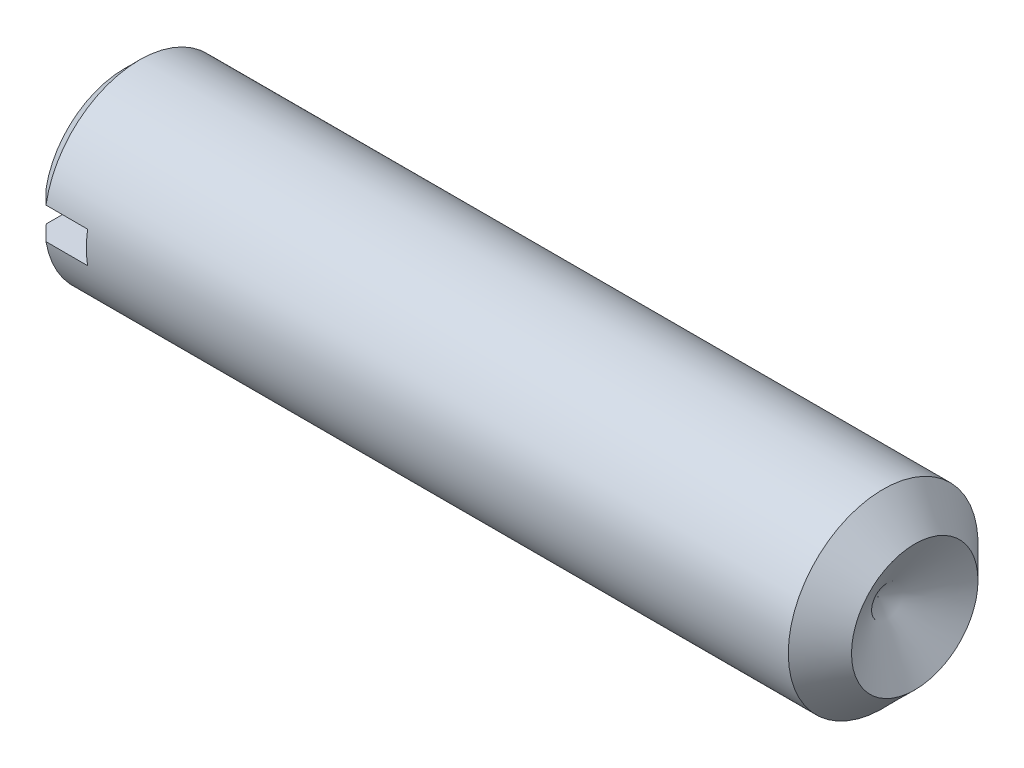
ISO-10303-21;
HEADER;
FILE_DESCRIPTION(('STEP AP214'),'2;1');
FILE_NAME('part.step','',(''),(''),'','','');
FILE_SCHEMA(('AUTOMOTIVE_DESIGN { 1 0 10303 214 1 1 1 1 }'));
ENDSEC;
DATA;
#1=APPLICATION_CONTEXT('core data for automotive mechanical design processes');
#2=APPLICATION_PROTOCOL_DEFINITION('international standard','automotive_design',2000,#1);
#3=PRODUCT_CONTEXT('',#1,'mechanical');
#4=PRODUCT('Part','Part','',(#3));
#5=PRODUCT_RELATED_PRODUCT_CATEGORY('part','',(#4));
#6=PRODUCT_DEFINITION_FORMATION('','',#4);
#7=PRODUCT_DEFINITION_CONTEXT('part definition',#1,'design');
#8=PRODUCT_DEFINITION('design','',#6,#7);
#9=PRODUCT_DEFINITION_SHAPE('','',#8);
#10=(LENGTH_UNIT() NAMED_UNIT(*) SI_UNIT(.MILLI.,.METRE.));
#11=(NAMED_UNIT(*) PLANE_ANGLE_UNIT() SI_UNIT($,.RADIAN.));
#12=(NAMED_UNIT(*) SI_UNIT($,.STERADIAN.) SOLID_ANGLE_UNIT());
#13=UNCERTAINTY_MEASURE_WITH_UNIT(LENGTH_MEASURE(1.E-05),#10,'distance_accuracy_value','');
#14=(GEOMETRIC_REPRESENTATION_CONTEXT(3) GLOBAL_UNCERTAINTY_ASSIGNED_CONTEXT((#13)) GLOBAL_UNIT_ASSIGNED_CONTEXT((#10,
#11,#12)) REPRESENTATION_CONTEXT('',''));
#15=CARTESIAN_POINT('',(0.,0.,0.));
#16=DIRECTION('',(0.,0.,1.));
#17=DIRECTION('',(1.,0.,0.));
#18=AXIS2_PLACEMENT_3D('',#15,#16,#17);
#19=CARTESIAN_POINT('',(0.,0.,0.));
#20=DIRECTION('',(1.,0.,0.));
#21=DIRECTION('',(0.,0.,-1.));
#22=AXIS2_PLACEMENT_3D('',#19,#20,#21);
#23=PLANE('',#22);
#24=DIRECTION('',(0.,0.,-1.));
#25=VECTOR('',#24,1.);
#26=CARTESIAN_POINT('',(0.,-1.,6.));
#27=LINE('',#26,#25);
#28=CARTESIAN_POINT('',(0.,-1.,4.93571636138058));
#29=VERTEX_POINT('',#28);
#30=CARTESIAN_POINT('',(0.,-1.,-4.93571636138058));
#31=VERTEX_POINT('',#30);
#32=EDGE_CURVE('E171',#29,#31,#27,.T.);
#33=ORIENTED_EDGE('',*,*,#32,.T.);
#34=CARTESIAN_POINT('',(0.,0.,0.));
#35=DIRECTION('',(-1.,0.,0.));
#36=DIRECTION('',(0.,0.,1.));
#37=AXIS2_PLACEMENT_3D('',#34,#35,#36);
#38=CIRCLE('',#37,5.036);
#39=EDGE_CURVE('E113',#31,#29,#38,.T.);
#40=ORIENTED_EDGE('',*,*,#39,.T.);
#41=EDGE_LOOP('',(#33,#40));
#42=FACE_BOUND('',#41,.T.);
#43=ADVANCED_FACE('F33',(#42),#23,.F.);
#44=DIRECTION('',(0.,0.,1.));
#45=VECTOR('',#44,1.);
#46=CARTESIAN_POINT('',(0.,1.,6.));
#47=LINE('',#46,#45);
#48=CARTESIAN_POINT('',(0.,1.,-4.93571636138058));
#49=VERTEX_POINT('',#48);
#50=CARTESIAN_POINT('',(0.,1.,4.93571636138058));
#51=VERTEX_POINT('',#50);
#52=EDGE_CURVE('E99',#49,#51,#47,.T.);
#53=ORIENTED_EDGE('',*,*,#52,.T.);
#54=EDGE_CURVE('E109',#51,#49,#38,.T.);
#55=ORIENTED_EDGE('',*,*,#54,.T.);
#56=EDGE_LOOP('',(#53,#55));
#57=FACE_BOUND('',#56,.T.);
#58=ADVANCED_FACE('F165',(#57),#23,.F.);
#59=CARTESIAN_POINT('',(0.964,0.,0.));
#60=DIRECTION('',(1.,0.,0.));
#61=DIRECTION('',(0.,0.,-1.));
#62=AXIS2_PLACEMENT_3D('',#59,#60,#61);
#63=CONICAL_SURFACE('',#62,6.,0.785398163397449);
#64=CARTESIAN_POINT('',(8.18739503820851,-1.,-13.185529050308));
#65=CARTESIAN_POINT('',(7.72173696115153,-1.,-12.71852199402));
#66=CARTESIAN_POINT('',(7.25613875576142,-1.,-12.2514551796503));
#67=CARTESIAN_POINT('',(6.32512700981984,-1.,-11.3171039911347));
#68=CARTESIAN_POINT('',(5.85971347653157,-1.,-10.8498196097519));
#69=CARTESIAN_POINT('',(4.92876157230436,-1.,-9.91455900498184));
#70=CARTESIAN_POINT('',(4.46322344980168,-1.,-9.44658253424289));
#71=CARTESIAN_POINT('',(3.53260322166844,-1.,-8.51020895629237));
#72=CARTESIAN_POINT('',(3.06752110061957,-1.,-8.04181186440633));
#73=CARTESIAN_POINT('',(2.15821966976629,-1.,-7.12462717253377));
#74=CARTESIAN_POINT('',(1.71396996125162,-1.,-6.67586973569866));
#75=CARTESIAN_POINT('',(1.04846409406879,-1.,-6.00182834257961));
#76=CARTESIAN_POINT('',(0.826761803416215,-1.,-5.77698500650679));
#77=CARTESIAN_POINT('',(0.383784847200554,-1.,-5.32688183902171));
#78=CARTESIAN_POINT('',(0.162510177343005,-1.,-5.10162201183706));
#79=CARTESIAN_POINT('',(-0.279302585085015,-1.,-4.65061661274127));
#80=CARTESIAN_POINT('',(-0.499841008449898,-1.,-4.42487136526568));
#81=CARTESIAN_POINT('',(-0.939964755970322,-1.,-3.97243637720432));
#82=CARTESIAN_POINT('',(-1.15955004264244,-1.,-3.74574660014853));
#83=CARTESIAN_POINT('',(-1.5971072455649,-1.,-3.29088888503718));
#84=CARTESIAN_POINT('',(-1.81507945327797,-1.,-3.06272122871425));
#85=CARTESIAN_POINT('',(-2.13978630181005,-1.,-2.71835823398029));
#86=CARTESIAN_POINT('',(-2.24764335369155,-1.,-2.60322226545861));
#87=CARTESIAN_POINT('',(-2.46225552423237,-1.,-2.37192883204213));
#88=CARTESIAN_POINT('',(-2.56901066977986,-1.,-2.25577139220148));
#89=CARTESIAN_POINT('',(-2.70433037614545,-1.,-2.10638744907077));
#90=CARTESIAN_POINT('',(-2.73367252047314,-1.,-2.07386514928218));
#91=CARTESIAN_POINT('',(-2.792206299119,-1.,-2.00868525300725));
#92=CARTESIAN_POINT('',(-2.82139793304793,-1.,-1.97602765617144));
#93=CARTESIAN_POINT('',(-2.90872232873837,-1.,-1.87782064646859));
#94=CARTESIAN_POINT('',(-2.96659914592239,-1.,-1.81204300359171));
#95=CARTESIAN_POINT('',(-3.08184804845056,-1.,-1.67922857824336));
#96=CARTESIAN_POINT('',(-3.13921368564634,-1.,-1.61218618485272));
#97=CARTESIAN_POINT('',(-3.25265645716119,-1.,-1.4770460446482));
#98=CARTESIAN_POINT('',(-3.30873392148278,-1.,-1.40894857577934));
#99=CARTESIAN_POINT('',(-3.41951675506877,-1.,-1.27072673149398));
#100=CARTESIAN_POINT('',(-3.47420734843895,-1.,-1.20059041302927));
#101=CARTESIAN_POINT('',(-3.58078617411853,-1.,-1.05824293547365));
#102=CARTESIAN_POINT('',(-3.63267529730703,-1.,-0.986032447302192));
#103=CARTESIAN_POINT('',(-3.73179995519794,-1.,-0.838985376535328));
#104=CARTESIAN_POINT('',(-3.77906004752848,-1.,-0.76416586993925));
#105=CARTESIAN_POINT('',(-3.84435481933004,-1.,-0.648848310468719));
#106=CARTESIAN_POINT('',(-3.86516971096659,-1.,-0.609933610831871));
#107=CARTESIAN_POINT('',(-3.90433594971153,-1.,-0.530890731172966));
#108=CARTESIAN_POINT('',(-3.9226886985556,-1.,-0.490763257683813));
#109=CARTESIAN_POINT('',(-3.95198906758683,-1.,-0.419353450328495));
#110=CARTESIAN_POINT('',(-3.96364182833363,-1.,-0.388362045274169));
#111=CARTESIAN_POINT('',(-3.98473496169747,-1.,-0.325623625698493));
#112=CARTESIAN_POINT('',(-3.99417524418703,-1.,-0.293876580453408));
#113=CARTESIAN_POINT('',(-4.01039189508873,-1.,-0.229839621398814));
#114=CARTESIAN_POINT('',(-4.0171791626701,-1.,-0.197552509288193));
#115=CARTESIAN_POINT('',(-4.02777094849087,-1.,-0.132494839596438));
#116=CARTESIAN_POINT('',(-4.03157640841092,-1.,-0.0997244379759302));
#117=CARTESIAN_POINT('',(-4.03598217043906,-1.,-0.0336377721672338));
#118=CARTESIAN_POINT('',(-4.03655046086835,-1.,-0.00031931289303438));
#119=CARTESIAN_POINT('',(-4.03436475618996,-1.,0.0662003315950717));
#120=CARTESIAN_POINT('',(-4.03161072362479,-1.,0.0994015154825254));
#121=CARTESIAN_POINT('',(-4.01857837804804,-1.,0.198547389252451));
#122=CARTESIAN_POINT('',(-4.0035212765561,-1.,0.263890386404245));
#123=CARTESIAN_POINT('',(-3.96875276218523,-1.,0.37567967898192));
#124=CARTESIAN_POINT('',(-3.95109708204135,-1.,0.422820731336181));
#125=CARTESIAN_POINT('',(-3.91176267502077,-1.,0.515422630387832));
#126=CARTESIAN_POINT('',(-3.89008085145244,-1.,0.560882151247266));
#127=CARTESIAN_POINT('',(-3.84368181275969,-1.,0.650461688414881));
#128=CARTESIAN_POINT('',(-3.81895103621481,-1.,0.694574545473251));
#129=CARTESIAN_POINT('',(-3.76733867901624,-1.,0.781486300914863));
#130=CARTESIAN_POINT('',(-3.74045800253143,-1.,0.824285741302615));
#131=CARTESIAN_POINT('',(-3.6797749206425,-1.,0.916951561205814));
#132=CARTESIAN_POINT('',(-3.64563502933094,-1.,0.966595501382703));
#133=CARTESIAN_POINT('',(-3.57571102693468,-1.,1.06471636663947));
#134=CARTESIAN_POINT('',(-3.5399265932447,-1.,1.11319305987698));
#135=CARTESIAN_POINT('',(-3.43072910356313,-1.,1.25732593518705));
#136=CARTESIAN_POINT('',(-3.35551889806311,-1.,1.35161593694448));
#137=CARTESIAN_POINT('',(-3.2021457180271,-1.,1.53811640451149));
#138=CARTESIAN_POINT('',(-3.12397592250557,-1.,1.63032117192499));
#139=CARTESIAN_POINT('',(-2.96588212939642,-1.,1.81314430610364));
#140=CARTESIAN_POINT('',(-2.88595886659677,-1.,1.90376330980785));
#141=CARTESIAN_POINT('',(-2.72475343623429,-1.,2.0841042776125));
#142=CARTESIAN_POINT('',(-2.64346888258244,-1.,2.17382409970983));
#143=CARTESIAN_POINT('',(-2.48004111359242,-1.,2.35249375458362));
#144=CARTESIAN_POINT('',(-2.3978978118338,-1.,2.44144350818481));
#145=CARTESIAN_POINT('',(-2.2331179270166,-1.,2.61862662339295));
#146=CARTESIAN_POINT('',(-2.15048230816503,-1.,2.70686088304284));
#147=CARTESIAN_POINT('',(-1.98474580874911,-1.,2.88288512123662));
#148=CARTESIAN_POINT('',(-1.90164494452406,-1.,2.97067511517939));
#149=CARTESIAN_POINT('',(-1.65336190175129,-1.,3.23190010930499));
#150=CARTESIAN_POINT('',(-1.48765764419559,-1.,3.40483867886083));
#151=CARTESIAN_POINT('',(-1.15536226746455,-1.,3.74986223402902));
#152=CARTESIAN_POINT('',(-0.988771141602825,-1.,3.92194721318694));
#153=CARTESIAN_POINT('',(-0.488104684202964,-1.,4.43735511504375));
#154=CARTESIAN_POINT('',(-0.15314670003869,-1.,4.77982011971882));
#155=CARTESIAN_POINT('',(0.518172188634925,-1.,5.46378768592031));
#156=CARTESIAN_POINT('',(0.854533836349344,-1.,5.80528951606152));
#157=CARTESIAN_POINT('',(1.5279690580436,-1.,6.48758005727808));
#158=CARTESIAN_POINT('',(1.86504262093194,-1.,6.82836877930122));
#159=CARTESIAN_POINT('',(2.53882709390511,-1.,7.50867429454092));
#160=CARTESIAN_POINT('',(2.87553691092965,-1.,7.84819217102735));
#161=CARTESIAN_POINT('',(3.5492645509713,-1.,8.52692488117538));
#162=CARTESIAN_POINT('',(3.88628237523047,-1.,8.86613971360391));
#163=CARTESIAN_POINT('',(4.8975465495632,-1.,9.88335866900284));
#164=CARTESIAN_POINT('',(5.57211148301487,-1.,10.5610460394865));
#165=CARTESIAN_POINT('',(6.40850112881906,-1.,11.4007367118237));
#166=CARTESIAN_POINT('',(6.57010906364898,-1.,11.5629560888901));
#167=CARTESIAN_POINT('',(6.89335366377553,-1.,11.8873745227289));
#168=CARTESIAN_POINT('',(7.05499032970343,-1.,12.0495735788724));
#169=CARTESIAN_POINT('',(7.37841272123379,-1.,12.3740784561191));
#170=CARTESIAN_POINT('',(7.5401984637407,-1.,12.5363842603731));
#171=CARTESIAN_POINT('',(7.86378498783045,-1.,12.8609725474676));
#172=CARTESIAN_POINT('',(8.02558576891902,-1.,13.0232550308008));
#173=CARTESIAN_POINT('',(8.18739503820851,-1.,13.185529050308));
#174=B_SPLINE_CURVE_WITH_KNOTS('',3,(#64,#65,#66,#67,#68,#69,#70,#71,#72,#73,#74,#75,#76,#77,
#78,#79,#80,#81,#82,#83,#84,#85,#86,#87,#88,#89,#90,#91,#92,#93,#94,#95,#96,#97,#98,#99,#100,
#101,#102,#103,#104,#105,#106,#107,#108,#109,#110,#111,#112,#113,#114,#115,#116,#117,#118,#119,
#120,#121,#122,#123,#124,#125,#126,#127,#128,#129,#130,#131,#132,#133,#134,#135,#136,#137,#138,
#139,#140,#141,#142,#143,#144,#145,#146,#147,#148,#149,#150,#151,#152,#153,#154,#155,#156,#157,
#158,#159,#160,#161,#162,#163,#164,#165,#166,#167,#168,#169,#170,#171,#172,#173),.UNSPECIFIED.,
.F.,.F.,(4,2,2,2,2,2,2,2,2,2,2,2,2,2,2,2,2,2,2,2,2,2,2,2,2,2,2,2,2,2,2,2,2,2,2,2,2,2,2,2,2,2,2,
2,2,2,2,2,2,2,2,2,2,2,4),(0.,1.97848364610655,3.95703862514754,5.93732867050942,
7.91754927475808,9.81192615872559,10.7592155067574,11.7064952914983,12.6532681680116,
13.6000779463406,14.546712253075,15.0199999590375,15.4932760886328,15.6246832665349,
15.7560907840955,16.0189300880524,16.2836250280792,16.5482513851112,16.8150192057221,
17.0817016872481,17.3468825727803,17.4792167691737,17.6114753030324,17.7107371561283,
17.8100030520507,17.9088567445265,18.007679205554,18.1074772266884,18.2072763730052,
18.4072998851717,18.5581246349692,18.7090658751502,18.8607045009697,19.012279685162,
19.1929820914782,19.3737200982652,19.7354462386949,20.0980639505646,20.4605325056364,
20.8237218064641,21.1869480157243,21.5496101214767,21.9122595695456,22.6307874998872,
23.3493208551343,24.7864327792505,26.2244388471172,27.6624226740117,29.0969303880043,
30.5314439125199,33.4000113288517,34.0869540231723,34.7739143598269,35.4614172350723,
36.148902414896),.UNSPECIFIED.);
#175=CARTESIAN_POINT('',(0.964,-1.,-5.91607978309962));
#176=VERTEX_POINT('',#175);
#177=EDGE_CURVE('E128',#176,#31,#174,.T.);
#178=ORIENTED_EDGE('',*,*,#177,.F.);
#179=CARTESIAN_POINT('',(0.964,0.,0.));
#180=DIRECTION('',(-1.,0.,0.));
#181=DIRECTION('',(0.,0.,1.));
#182=AXIS2_PLACEMENT_3D('',#179,#180,#181);
#183=CIRCLE('',#182,6.);
#184=CARTESIAN_POINT('',(0.964,-1.,5.91607978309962));
#185=VERTEX_POINT('',#184);
#186=EDGE_CURVE('E120',#176,#185,#183,.T.);
#187=ORIENTED_EDGE('',*,*,#186,.T.);
#188=EDGE_CURVE('E87',#29,#185,#174,.T.);
#189=ORIENTED_EDGE('',*,*,#188,.F.);
#190=ORIENTED_EDGE('',*,*,#39,.F.);
#191=EDGE_LOOP('',(#178,#187,#189,#190));
#192=FACE_BOUND('',#191,.T.);
#193=ADVANCED_FACE('F141',(#192),#63,.T.);
#194=CARTESIAN_POINT('',(8.18739503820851,1.,13.1855290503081));
#195=CARTESIAN_POINT('',(7.72173696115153,1.,12.71852199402));
#196=CARTESIAN_POINT('',(7.25613875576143,1.,12.2514551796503));
#197=CARTESIAN_POINT('',(6.32512700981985,1.,11.3171039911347));
#198=CARTESIAN_POINT('',(5.85971347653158,1.,10.8498196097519));
#199=CARTESIAN_POINT('',(4.92876157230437,1.,9.91455900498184));
#200=CARTESIAN_POINT('',(4.46322344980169,1.,9.4465825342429));
#201=CARTESIAN_POINT('',(3.53260322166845,1.,8.51020895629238));
#202=CARTESIAN_POINT('',(3.06752110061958,1.,8.04181186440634));
#203=CARTESIAN_POINT('',(2.1582196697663,1.,7.12462717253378));
#204=CARTESIAN_POINT('',(1.71396996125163,1.,6.67586973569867));
#205=CARTESIAN_POINT('',(1.0484640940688,1.,6.00182834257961));
#206=CARTESIAN_POINT('',(0.826761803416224,1.,5.7769850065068));
#207=CARTESIAN_POINT('',(0.383784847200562,1.,5.32688183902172));
#208=CARTESIAN_POINT('',(0.162510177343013,1.,5.10162201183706));
#209=CARTESIAN_POINT('',(-0.279302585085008,1.,4.65061661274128));
#210=CARTESIAN_POINT('',(-0.499841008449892,1.,4.42487136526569));
#211=CARTESIAN_POINT('',(-0.939964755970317,1.,3.97243637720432));
#212=CARTESIAN_POINT('',(-1.15955004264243,1.,3.74574660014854));
#213=CARTESIAN_POINT('',(-1.59710724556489,1.,3.29088888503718));
#214=CARTESIAN_POINT('',(-1.81507945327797,1.,3.06272122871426));
#215=CARTESIAN_POINT('',(-2.13978630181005,1.,2.71835823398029));
#216=CARTESIAN_POINT('',(-2.24764335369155,1.,2.60322226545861));
#217=CARTESIAN_POINT('',(-2.46225552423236,1.,2.37192883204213));
#218=CARTESIAN_POINT('',(-2.56901066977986,1.,2.25577139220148));
#219=CARTESIAN_POINT('',(-2.70433037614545,1.,2.10638744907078));
#220=CARTESIAN_POINT('',(-2.73367252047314,1.,2.07386514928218));
#221=CARTESIAN_POINT('',(-2.792206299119,1.,2.00868525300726));
#222=CARTESIAN_POINT('',(-2.82139793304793,1.,1.97602765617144));
#223=CARTESIAN_POINT('',(-2.90872232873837,1.,1.8778206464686));
#224=CARTESIAN_POINT('',(-2.96659914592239,1.,1.81204300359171));
#225=CARTESIAN_POINT('',(-3.08184804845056,1.,1.67922857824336));
#226=CARTESIAN_POINT('',(-3.13921368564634,1.,1.61218618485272));
#227=CARTESIAN_POINT('',(-3.25265645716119,1.,1.4770460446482));
#228=CARTESIAN_POINT('',(-3.30873392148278,1.,1.40894857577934));
#229=CARTESIAN_POINT('',(-3.41951675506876,1.,1.27072673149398));
#230=CARTESIAN_POINT('',(-3.47420734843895,1.,1.20059041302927));
#231=CARTESIAN_POINT('',(-3.58078617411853,1.,1.05824293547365));
#232=CARTESIAN_POINT('',(-3.63267529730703,1.,0.986032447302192));
#233=CARTESIAN_POINT('',(-3.73179995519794,1.,0.838985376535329));
#234=CARTESIAN_POINT('',(-3.77906004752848,1.,0.764165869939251));
#235=CARTESIAN_POINT('',(-3.84435481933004,1.,0.648848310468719));
#236=CARTESIAN_POINT('',(-3.86516971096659,1.,0.60993361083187));
#237=CARTESIAN_POINT('',(-3.90433594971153,1.,0.530890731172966));
#238=CARTESIAN_POINT('',(-3.9226886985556,1.,0.490763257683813));
#239=CARTESIAN_POINT('',(-3.95198906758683,1.,0.419353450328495));
#240=CARTESIAN_POINT('',(-3.96364182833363,1.,0.388362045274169));
#241=CARTESIAN_POINT('',(-3.98473496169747,1.,0.325623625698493));
#242=CARTESIAN_POINT('',(-3.99417524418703,1.,0.293876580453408));
#243=CARTESIAN_POINT('',(-4.01039189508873,1.,0.229839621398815));
#244=CARTESIAN_POINT('',(-4.0171791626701,1.,0.197552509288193));
#245=CARTESIAN_POINT('',(-4.02777094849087,1.,0.132494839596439));
#246=CARTESIAN_POINT('',(-4.03157640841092,1.,0.0997244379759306));
#247=CARTESIAN_POINT('',(-4.03598217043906,1.,0.0336377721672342));
#248=CARTESIAN_POINT('',(-4.03655046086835,1.,0.000319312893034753));
#249=CARTESIAN_POINT('',(-4.03436475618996,1.,-0.0662003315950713));
#250=CARTESIAN_POINT('',(-4.03161072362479,1.,-0.099401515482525));
#251=CARTESIAN_POINT('',(-4.01857837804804,1.,-0.198547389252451));
#252=CARTESIAN_POINT('',(-4.0035212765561,1.,-0.263890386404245));
#253=CARTESIAN_POINT('',(-3.96875276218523,1.,-0.375679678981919));
#254=CARTESIAN_POINT('',(-3.95109708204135,1.,-0.422820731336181));
#255=CARTESIAN_POINT('',(-3.91176267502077,1.,-0.515422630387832));
#256=CARTESIAN_POINT('',(-3.89008085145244,1.,-0.560882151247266));
#257=CARTESIAN_POINT('',(-3.84368181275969,1.,-0.650461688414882));
#258=CARTESIAN_POINT('',(-3.81895103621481,1.,-0.694574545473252));
#259=CARTESIAN_POINT('',(-3.76733867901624,1.,-0.781486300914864));
#260=CARTESIAN_POINT('',(-3.74045800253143,1.,-0.824285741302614));
#261=CARTESIAN_POINT('',(-3.6797749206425,1.,-0.916951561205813));
#262=CARTESIAN_POINT('',(-3.64563502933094,1.,-0.966595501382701));
#263=CARTESIAN_POINT('',(-3.57571102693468,1.,-1.06471636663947));
#264=CARTESIAN_POINT('',(-3.5399265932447,1.,-1.11319305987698));
#265=CARTESIAN_POINT('',(-3.43072910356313,1.,-1.25732593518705));
#266=CARTESIAN_POINT('',(-3.35551889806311,1.,-1.35161593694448));
#267=CARTESIAN_POINT('',(-3.2021457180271,1.,-1.53811640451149));
#268=CARTESIAN_POINT('',(-3.12397592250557,1.,-1.63032117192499));
#269=CARTESIAN_POINT('',(-2.96588212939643,1.,-1.81314430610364));
#270=CARTESIAN_POINT('',(-2.88595886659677,1.,-1.90376330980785));
#271=CARTESIAN_POINT('',(-2.72475343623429,1.,-2.0841042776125));
#272=CARTESIAN_POINT('',(-2.64346888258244,1.,-2.17382409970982));
#273=CARTESIAN_POINT('',(-2.48004111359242,1.,-2.35249375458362));
#274=CARTESIAN_POINT('',(-2.3978978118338,1.,-2.44144350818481));
#275=CARTESIAN_POINT('',(-2.2331179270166,1.,-2.61862662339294));
#276=CARTESIAN_POINT('',(-2.15048230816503,1.,-2.70686088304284));
#277=CARTESIAN_POINT('',(-1.98474580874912,1.,-2.88288512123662));
#278=CARTESIAN_POINT('',(-1.90164494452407,1.,-2.97067511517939));
#279=CARTESIAN_POINT('',(-1.65336190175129,1.,-3.23190010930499));
#280=CARTESIAN_POINT('',(-1.48765764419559,1.,-3.40483867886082));
#281=CARTESIAN_POINT('',(-1.15536226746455,1.,-3.74986223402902));
#282=CARTESIAN_POINT('',(-0.98877114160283,1.,-3.92194721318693));
#283=CARTESIAN_POINT('',(-0.488104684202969,1.,-4.43735511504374));
#284=CARTESIAN_POINT('',(-0.153146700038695,1.,-4.77982011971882));
#285=CARTESIAN_POINT('',(0.518172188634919,1.,-5.4637876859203));
#286=CARTESIAN_POINT('',(0.854533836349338,1.,-5.80528951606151));
#287=CARTESIAN_POINT('',(1.52796905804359,1.,-6.48758005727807));
#288=CARTESIAN_POINT('',(1.86504262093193,1.,-6.82836877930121));
#289=CARTESIAN_POINT('',(2.5388270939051,1.,-7.50867429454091));
#290=CARTESIAN_POINT('',(2.87553691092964,1.,-7.84819217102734));
#291=CARTESIAN_POINT('',(3.54926455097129,1.,-8.52692488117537));
#292=CARTESIAN_POINT('',(3.88628237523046,1.,-8.8661397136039));
#293=CARTESIAN_POINT('',(4.89754654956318,1.,-9.88335866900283));
#294=CARTESIAN_POINT('',(5.57211148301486,1.,-10.5610460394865));
#295=CARTESIAN_POINT('',(6.40850112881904,1.,-11.4007367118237));
#296=CARTESIAN_POINT('',(6.57010906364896,1.,-11.5629560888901));
#297=CARTESIAN_POINT('',(6.89335366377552,1.,-11.8873745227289));
#298=CARTESIAN_POINT('',(7.05499032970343,1.,-12.0495735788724));
#299=CARTESIAN_POINT('',(7.37841272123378,1.,-12.3740784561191));
#300=CARTESIAN_POINT('',(7.5401984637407,1.,-12.5363842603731));
#301=CARTESIAN_POINT('',(7.86378498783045,1.,-12.8609725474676));
#302=CARTESIAN_POINT('',(8.02558576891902,1.,-13.0232550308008));
#303=CARTESIAN_POINT('',(8.18739503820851,1.,-13.1855290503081));
#304=B_SPLINE_CURVE_WITH_KNOTS('',3,(#194,#195,#196,#197,#198,#199,#200,#201,#202,#203,#204,
#205,#206,#207,#208,#209,#210,#211,#212,#213,#214,#215,#216,#217,#218,#219,#220,#221,#222,#223,
#224,#225,#226,#227,#228,#229,#230,#231,#232,#233,#234,#235,#236,#237,#238,#239,#240,#241,#242,
#243,#244,#245,#246,#247,#248,#249,#250,#251,#252,#253,#254,#255,#256,#257,#258,#259,#260,#261,
#262,#263,#264,#265,#266,#267,#268,#269,#270,#271,#272,#273,#274,#275,#276,#277,#278,#279,#280,
#281,#282,#283,#284,#285,#286,#287,#288,#289,#290,#291,#292,#293,#294,#295,#296,#297,#298,#299,
#300,#301,#302,#303),.UNSPECIFIED.,.F.,.F.,(4,2,2,2,2,2,2,2,2,2,2,2,2,2,2,2,2,2,2,2,2,2,2,2,2,2,
2,2,2,2,2,2,2,2,2,2,2,2,2,2,2,2,2,2,2,2,2,2,2,2,2,2,2,2,4),(0.,1.97848364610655,
3.95703862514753,5.93732867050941,7.91754927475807,9.81192615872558,10.7592155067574,
11.7064952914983,12.6532681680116,13.6000779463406,14.546712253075,15.0199999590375,
15.4932760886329,15.6246832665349,15.7560907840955,16.0189300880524,16.2836250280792,
16.5482513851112,16.8150192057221,17.0817016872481,17.3468825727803,17.4792167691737,
17.6114753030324,17.7107371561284,17.8100030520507,17.9088567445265,18.007679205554,
18.1074772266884,18.2072763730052,18.4072998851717,18.5581246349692,18.7090658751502,
18.8607045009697,19.012279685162,19.1929820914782,19.3737200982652,19.7354462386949,
20.0980639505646,20.4605325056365,20.8237218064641,21.1869480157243,21.5496101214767,
21.9122595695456,22.6307874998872,23.3493208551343,24.7864327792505,26.2244388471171,
27.6624226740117,29.0969303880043,30.5314439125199,33.4000113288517,34.0869540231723,
34.7739143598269,35.4614172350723,36.148902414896),.UNSPECIFIED.);
#305=CARTESIAN_POINT('',(0.964,1.,5.91607978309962));
#306=VERTEX_POINT('',#305);
#307=EDGE_CURVE('E134',#306,#51,#304,.T.);
#308=ORIENTED_EDGE('',*,*,#307,.F.);
#309=CARTESIAN_POINT('',(0.964,1.,-5.91607978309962));
#310=VERTEX_POINT('',#309);
#311=EDGE_CURVE('E118',#306,#310,#183,.T.);
#312=ORIENTED_EDGE('',*,*,#311,.T.);
#313=EDGE_CURVE('E135',#49,#310,#304,.T.);
#314=ORIENTED_EDGE('',*,*,#313,.F.);
#315=ORIENTED_EDGE('',*,*,#54,.F.);
#316=EDGE_LOOP('',(#308,#312,#314,#315));
#317=FACE_BOUND('',#316,.T.);
#318=ADVANCED_FACE('F158',(#317),#63,.T.);
#319=CARTESIAN_POINT('',(0.,0.,0.));
#320=DIRECTION('',(-1.,0.,0.));
#321=DIRECTION('',(0.,0.,1.));
#322=AXIS2_PLACEMENT_3D('',#319,#320,#321);
#323=CYLINDRICAL_SURFACE('',#322,6.);
#324=CARTESIAN_POINT('',(48.,0.,0.));
#325=DIRECTION('',(-1.,0.,0.));
#326=DIRECTION('',(0.,0.,1.));
#327=AXIS2_PLACEMENT_3D('',#324,#325,#326);
#328=CIRCLE('',#327,6.);
#329=CARTESIAN_POINT('',(48.,0.,6.));
#330=VERTEX_POINT('',#329);
#331=EDGE_CURVE('E122',#330,#330,#328,.T.);
#332=ORIENTED_EDGE('',*,*,#331,.T.);
#333=EDGE_LOOP('',(#332));
#334=FACE_BOUND('',#333,.T.);
#335=DIRECTION('',(-1.,0.,0.));
#336=VECTOR('',#335,1.);
#337=CARTESIAN_POINT('',(0.,-1.,5.91607978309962));
#338=LINE('',#337,#336);
#339=CARTESIAN_POINT('',(3.6,-1.,5.91607978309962));
#340=VERTEX_POINT('',#339);
#341=EDGE_CURVE('E11',#185,#340,#338,.F.);
#342=ORIENTED_EDGE('',*,*,#341,.F.);
#343=ORIENTED_EDGE('',*,*,#186,.F.);
#344=DIRECTION('',(-1.,0.,0.));
#345=VECTOR('',#344,1.);
#346=CARTESIAN_POINT('',(0.,-1.,-5.91607978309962));
#347=LINE('',#346,#345);
#348=CARTESIAN_POINT('',(3.6,-1.,-5.91607978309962));
#349=VERTEX_POINT('',#348);
#350=EDGE_CURVE('E50',#349,#176,#347,.T.);
#351=ORIENTED_EDGE('',*,*,#350,.F.);
#352=CARTESIAN_POINT('',(3.6,0.,0.));
#353=DIRECTION('',(1.,0.,0.));
#354=DIRECTION('',(0.,0.,-1.));
#355=AXIS2_PLACEMENT_3D('',#352,#353,#354);
#356=CIRCLE('',#355,6.);
#357=CARTESIAN_POINT('',(3.6,1.,-5.91607978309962));
#358=VERTEX_POINT('',#357);
#359=EDGE_CURVE('E97',#349,#358,#356,.T.);
#360=ORIENTED_EDGE('',*,*,#359,.T.);
#361=DIRECTION('',(-1.,0.,0.));
#362=VECTOR('',#361,1.);
#363=CARTESIAN_POINT('',(0.,1.,-5.91607978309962));
#364=LINE('',#363,#362);
#365=EDGE_CURVE('E105',#310,#358,#364,.F.);
#366=ORIENTED_EDGE('',*,*,#365,.F.);
#367=ORIENTED_EDGE('',*,*,#311,.F.);
#368=DIRECTION('',(-1.,0.,0.));
#369=VECTOR('',#368,1.);
#370=CARTESIAN_POINT('',(0.,1.,5.91607978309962));
#371=LINE('',#370,#369);
#372=CARTESIAN_POINT('',(3.6,1.,5.91607978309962));
#373=VERTEX_POINT('',#372);
#374=EDGE_CURVE('E40',#373,#306,#371,.T.);
#375=ORIENTED_EDGE('',*,*,#374,.F.);
#376=EDGE_CURVE('E95',#373,#340,#356,.T.);
#377=ORIENTED_EDGE('',*,*,#376,.T.);
#378=EDGE_LOOP('',(#342,#343,#351,#360,#366,#367,#375,#377));
#379=FACE_BOUND('',#378,.T.);
#380=ADVANCED_FACE('F102',(#334,#379),#323,.T.);
#381=CARTESIAN_POINT('',(50.,0.,0.));
#382=DIRECTION('',(-1.,0.,0.));
#383=DIRECTION('',(0.,0.,1.));
#384=AXIS2_PLACEMENT_3D('',#381,#382,#383);
#385=CONICAL_SURFACE('',#384,4.,0.785398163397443);
#386=ORIENTED_EDGE('',*,*,#331,.F.);
#387=EDGE_LOOP('',(#386));
#388=FACE_BOUND('',#387,.T.);
#389=CARTESIAN_POINT('',(50.,0.,0.));
#390=DIRECTION('',(-1.,0.,0.));
#391=DIRECTION('',(0.,0.,1.));
#392=AXIS2_PLACEMENT_3D('',#389,#390,#391);
#393=CIRCLE('',#392,4.);
#394=CARTESIAN_POINT('',(50.,0.,4.));
#395=VERTEX_POINT('',#394);
#396=EDGE_CURVE('E125',#395,#395,#393,.T.);
#397=ORIENTED_EDGE('',*,*,#396,.T.);
#398=EDGE_LOOP('',(#397));
#399=FACE_BOUND('',#398,.T.);
#400=ADVANCED_FACE('F153',(#388,#399),#385,.T.);
#401=CARTESIAN_POINT('',(47.6905989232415,0.,0.));
#402=DIRECTION('',(1.,0.,0.));
#403=DIRECTION('',(0.,0.,-1.));
#404=AXIS2_PLACEMENT_3D('',#401,#402,#403);
#405=CONICAL_SURFACE('',#404,0.,1.0471975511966);
#406=ORIENTED_EDGE('',*,*,#396,.F.);
#407=EDGE_LOOP('',(#406));
#408=FACE_BOUND('',#407,.T.);
#409=CARTESIAN_POINT('',(47.6905989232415,0.,0.));
#410=VERTEX_POINT('',#409);
#411=VERTEX_LOOP('',#410);
#412=FACE_BOUND('',#411,.T.);
#413=ADVANCED_FACE('F148',(#408,#412),#405,.F.);
#414=CARTESIAN_POINT('',(3.6,-1.,6.));
#415=DIRECTION('',(0.,1.,0.));
#416=DIRECTION('',(0.,0.,1.));
#417=AXIS2_PLACEMENT_3D('',#414,#415,#416);
#418=PLANE('',#417);
#419=ORIENTED_EDGE('',*,*,#177,.T.);
#420=ORIENTED_EDGE('',*,*,#32,.F.);
#421=ORIENTED_EDGE('',*,*,#188,.T.);
#422=ORIENTED_EDGE('',*,*,#341,.T.);
#423=DIRECTION('',(0.,0.,-1.));
#424=VECTOR('',#423,1.);
#425=CARTESIAN_POINT('',(3.6,-1.,6.));
#426=LINE('',#425,#424);
#427=EDGE_CURVE('E85',#340,#349,#426,.T.);
#428=ORIENTED_EDGE('',*,*,#427,.T.);
#429=ORIENTED_EDGE('',*,*,#350,.T.);
#430=EDGE_LOOP('',(#419,#420,#421,#422,#428,#429));
#431=FACE_BOUND('',#430,.T.);
#432=ADVANCED_FACE('F84',(#431),#418,.T.);
#433=CARTESIAN_POINT('',(3.6,1.,6.));
#434=DIRECTION('',(0.,-1.,0.));
#435=DIRECTION('',(0.,0.,-1.));
#436=AXIS2_PLACEMENT_3D('',#433,#434,#435);
#437=PLANE('',#436);
#438=ORIENTED_EDGE('',*,*,#307,.T.);
#439=ORIENTED_EDGE('',*,*,#52,.F.);
#440=ORIENTED_EDGE('',*,*,#313,.T.);
#441=ORIENTED_EDGE('',*,*,#365,.T.);
#442=DIRECTION('',(0.,0.,1.));
#443=VECTOR('',#442,1.);
#444=CARTESIAN_POINT('',(3.6,1.,6.));
#445=LINE('',#444,#443);
#446=EDGE_CURVE('E98',#358,#373,#445,.T.);
#447=ORIENTED_EDGE('',*,*,#446,.T.);
#448=ORIENTED_EDGE('',*,*,#374,.T.);
#449=EDGE_LOOP('',(#438,#439,#440,#441,#447,#448));
#450=FACE_BOUND('',#449,.T.);
#451=ADVANCED_FACE('F147',(#450),#437,.T.);
#452=CARTESIAN_POINT('',(3.6,-1.,6.));
#453=DIRECTION('',(1.,0.,0.));
#454=DIRECTION('',(0.,0.,-1.));
#455=AXIS2_PLACEMENT_3D('',#452,#453,#454);
#456=PLANE('',#455);
#457=ORIENTED_EDGE('',*,*,#446,.F.);
#458=ORIENTED_EDGE('',*,*,#359,.F.);
#459=ORIENTED_EDGE('',*,*,#427,.F.);
#460=ORIENTED_EDGE('',*,*,#376,.F.);
#461=EDGE_LOOP('',(#457,#458,#459,#460));
#462=FACE_BOUND('',#461,.T.);
#463=ADVANCED_FACE('F94',(#462),#456,.F.);
#464=CLOSED_SHELL('',(#43,#58,#193,#318,#380,#400,#413,#432,#451,#463));
#465=MANIFOLD_SOLID_BREP('B2',#464);
#466=ADVANCED_BREP_SHAPE_REPRESENTATION('',(#18,#465),#14);
#467=SHAPE_DEFINITION_REPRESENTATION(#9,#466);
ENDSEC;
END-ISO-10303-21;
